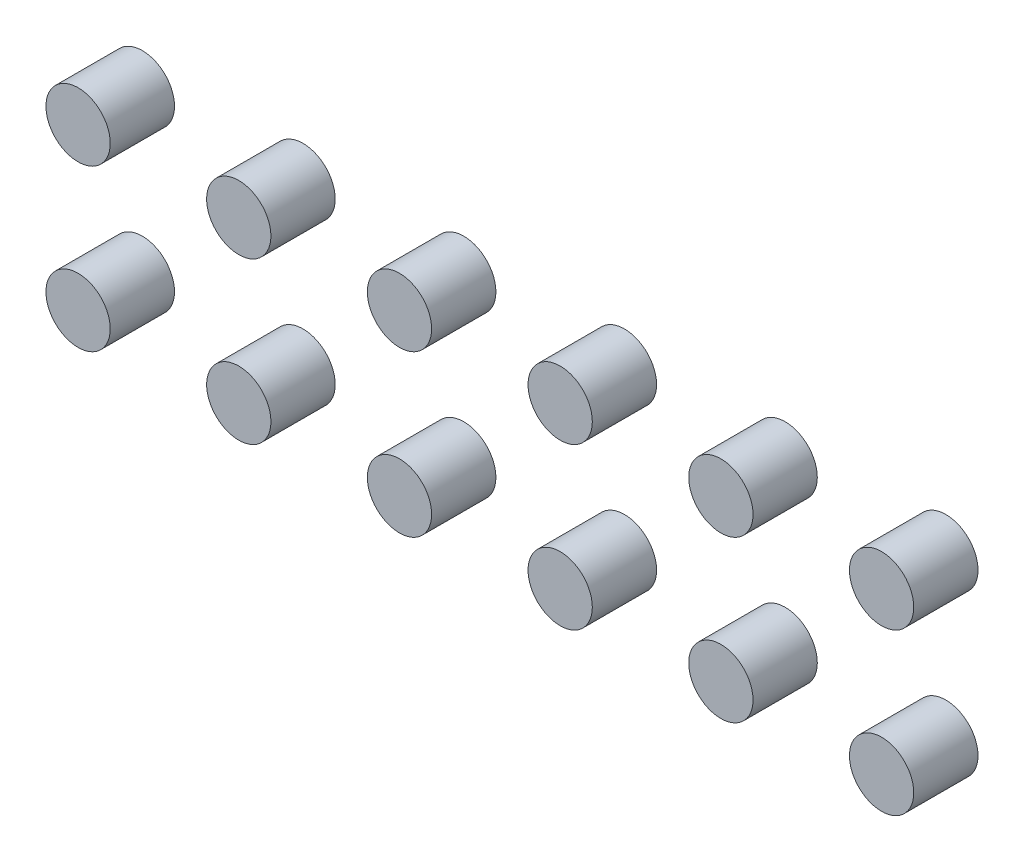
from build123d import *

# Parameters (mm, degrees)
EXTRUDE1_DEPTH         = 10
EXTRUDE1_DEPTH_BACK    = 10
SKETCH1_R              = 10
EXTRUDE1_2_DEPTH       = 10
EXTRUDE1_2_DEPTH_BACK  = 10
EXTRUDE1_3_DEPTH       = 10
EXTRUDE1_3_DEPTH_BACK  = 10
EXTRUDE1_4_DEPTH       = 10
EXTRUDE1_4_DEPTH_BACK  = 10
EXTRUDE1_5_DEPTH       = 10
EXTRUDE1_5_DEPTH_BACK  = 10
EXTRUDE1_6_DEPTH       = 10
EXTRUDE1_6_DEPTH_BACK  = 10
EXTRUDE1_7_DEPTH       = 10
EXTRUDE1_7_DEPTH_BACK  = 10
EXTRUDE1_8_DEPTH       = 10
EXTRUDE1_8_DEPTH_BACK  = 10
EXTRUDE1_9_DEPTH       = 10
EXTRUDE1_9_DEPTH_BACK  = 10
EXTRUDE1_10_DEPTH      = 10
EXTRUDE1_10_DEPTH_BACK = 10
EXTRUDE1_11_DEPTH      = 10
EXTRUDE1_11_DEPTH_BACK = 10
EXTRUDE1_12_DEPTH      = 10
EXTRUDE1_12_DEPTH_BACK = 10


with BuildPart() as part:
    # Sketch1 → Extrude1 (new, two sides: drawn at the far end of the back side and taken through both)
    with BuildSketch(Plane.XY.offset(-EXTRUDE1_DEPTH_BACK)):
        Circle(SKETCH1_R)
    extrude(amount=EXTRUDE1_DEPTH + EXTRUDE1_DEPTH_BACK)


with BuildPart() as body_2:
    # Sketch1 → Extrude1 2 (new, two sides: drawn at the far end of the back side and taken through both)
    with BuildSketch(Plane.XY.offset(-EXTRUDE1_2_DEPTH_BACK)):
        with Locations((50, 0)):
            Circle(SKETCH1_R)
    extrude(amount=EXTRUDE1_2_DEPTH + EXTRUDE1_2_DEPTH_BACK)


with BuildPart() as body_3:
    # Sketch1 → Extrude1 3 (new, two sides: drawn at the far end of the back side and taken through both)
    with BuildSketch(Plane.XY.offset(-EXTRUDE1_3_DEPTH_BACK)):
        with Locations((100, 0)):
            Circle(SKETCH1_R)
    extrude(amount=EXTRUDE1_3_DEPTH + EXTRUDE1_3_DEPTH_BACK)


with BuildPart() as body_4:
    # Sketch1 → Extrude1 4 (new, two sides: drawn at the far end of the back side and taken through both)
    with BuildSketch(Plane.XY.offset(-EXTRUDE1_4_DEPTH_BACK)):
        with Locations((150, 0)):
            Circle(SKETCH1_R)
    extrude(amount=EXTRUDE1_4_DEPTH + EXTRUDE1_4_DEPTH_BACK)


with BuildPart() as body_5:
    # Sketch1 → Extrude1 5 (new, two sides: drawn at the far end of the back side and taken through both)
    with BuildSketch(Plane.XY.offset(-EXTRUDE1_5_DEPTH_BACK)):
        with Locations((200, 0)):
            Circle(SKETCH1_R)
    extrude(amount=EXTRUDE1_5_DEPTH + EXTRUDE1_5_DEPTH_BACK)


with BuildPart() as body_6:
    # Sketch1 → Extrude1 6 (new, two sides: drawn at the far end of the back side and taken through both)
    with BuildSketch(Plane.XY.offset(-EXTRUDE1_6_DEPTH_BACK)):
        with Locations((250, 0)):
            Circle(SKETCH1_R)
    extrude(amount=EXTRUDE1_6_DEPTH + EXTRUDE1_6_DEPTH_BACK)


with BuildPart() as body_7:
    # Sketch1 → Extrude1 7 (new, two sides: drawn at the far end of the back side and taken through both)
    with BuildSketch(Plane.XY.offset(-EXTRUDE1_7_DEPTH_BACK)):
        with Locations((0, 50)):
            Circle(SKETCH1_R)
    extrude(amount=EXTRUDE1_7_DEPTH + EXTRUDE1_7_DEPTH_BACK)


with BuildPart() as body_8:
    # Sketch1 → Extrude1 8 (new, two sides: drawn at the far end of the back side and taken through both)
    with BuildSketch(Plane.XY.offset(-EXTRUDE1_8_DEPTH_BACK)):
        with Locations((50, 50)):
            Circle(SKETCH1_R)
    extrude(amount=EXTRUDE1_8_DEPTH + EXTRUDE1_8_DEPTH_BACK)


with BuildPart() as body_9:
    # Sketch1 → Extrude1 9 (new, two sides: drawn at the far end of the back side and taken through both)
    with BuildSketch(Plane.XY.offset(-EXTRUDE1_9_DEPTH_BACK)):
        with Locations((100, 50)):
            Circle(SKETCH1_R)
    extrude(amount=EXTRUDE1_9_DEPTH + EXTRUDE1_9_DEPTH_BACK)


with BuildPart() as body_10:
    # Sketch1 → Extrude1 10 (new, two sides: drawn at the far end of the back side and taken through both)
    with BuildSketch(Plane.XY.offset(-EXTRUDE1_10_DEPTH_BACK)):
        with Locations((150, 50)):
            Circle(SKETCH1_R)
    extrude(amount=EXTRUDE1_10_DEPTH + EXTRUDE1_10_DEPTH_BACK)


with BuildPart() as body_11:
    # Sketch1 → Extrude1 11 (new, two sides: drawn at the far end of the back side and taken through both)
    with BuildSketch(Plane.XY.offset(-EXTRUDE1_11_DEPTH_BACK)):
        with Locations((200, 50)):
            Circle(SKETCH1_R)
    extrude(amount=EXTRUDE1_11_DEPTH + EXTRUDE1_11_DEPTH_BACK)


with BuildPart() as body_12:
    # Sketch1 → Extrude1 12 (new, two sides: drawn at the far end of the back side and taken through both)
    with BuildSketch(Plane.XY.offset(-EXTRUDE1_12_DEPTH_BACK)):
        with Locations((250, 50)):
            Circle(SKETCH1_R)
    extrude(amount=EXTRUDE1_12_DEPTH + EXTRUDE1_12_DEPTH_BACK)


solid = Compound([part.part, body_2.part, body_3.part, body_4.part, body_5.part, body_6.part, body_7.part, body_8.part, body_9.part, body_10.part, body_11.part, body_12.part])
